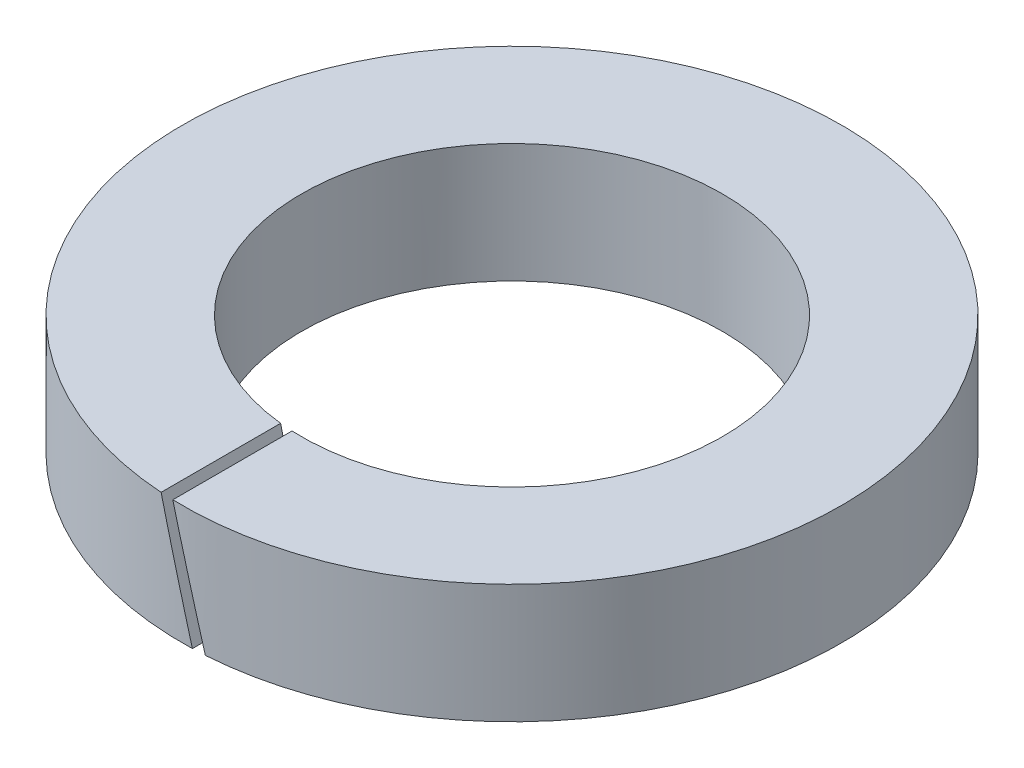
from build123d import *

# Parameters (mm, degrees)
ESQUISSE1_W      = 1.5
ESQUISSE1_H      = 1.5
FENTE_REACH      = 11.4
FENTE_END_RADIUS = 2.65


with BuildPart() as part:
    # Esquisse1 → Base (revolve)
    with BuildSketch(Plane.XY, mode=Mode.PRIVATE) as base_sk:
        with Locations((3.4, 0.75)):
            Rectangle(ESQUISSE1_W, ESQUISSE1_H)
    revolve(base_sk.sketch.rotate(Axis((0, 0.5, 0), (0, -1, 0)), 90), axis=Axis((0, 0.5, 0), (0, -1, 0)))

    # Fente: up to this cylinder (the profile starts outside it)
    fente_end = Plane(origin=(0, 0.75, 0), z_dir=(0, 1, 0)) * Cylinder(FENTE_END_RADIUS, 29.1, mode=Mode.PRIVATE)
    # Esquisse2 → Fente (cut, up to the surface)
    with BuildSketch(Plane.XY.offset(4.15), mode=Mode.PRIVATE) as fente_sk1:
        Polygon((-0.474368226, 2.230588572), (-0.072444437, 0.730588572), (0.329479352, -0.769411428), (0.474368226, -0.730588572), (0.072444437, 0.769411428), (-0.329479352, 2.269411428), align=None)
    fente_tool1 = extrude(fente_sk1.sketch, amount=-FENTE_REACH, mode=Mode.PRIVATE) - fente_end
    add(fente_tool1.solids().sort_by_distance((0, 0.75, 4.15))[0], mode=Mode.SUBTRACT)


solid = part.part
